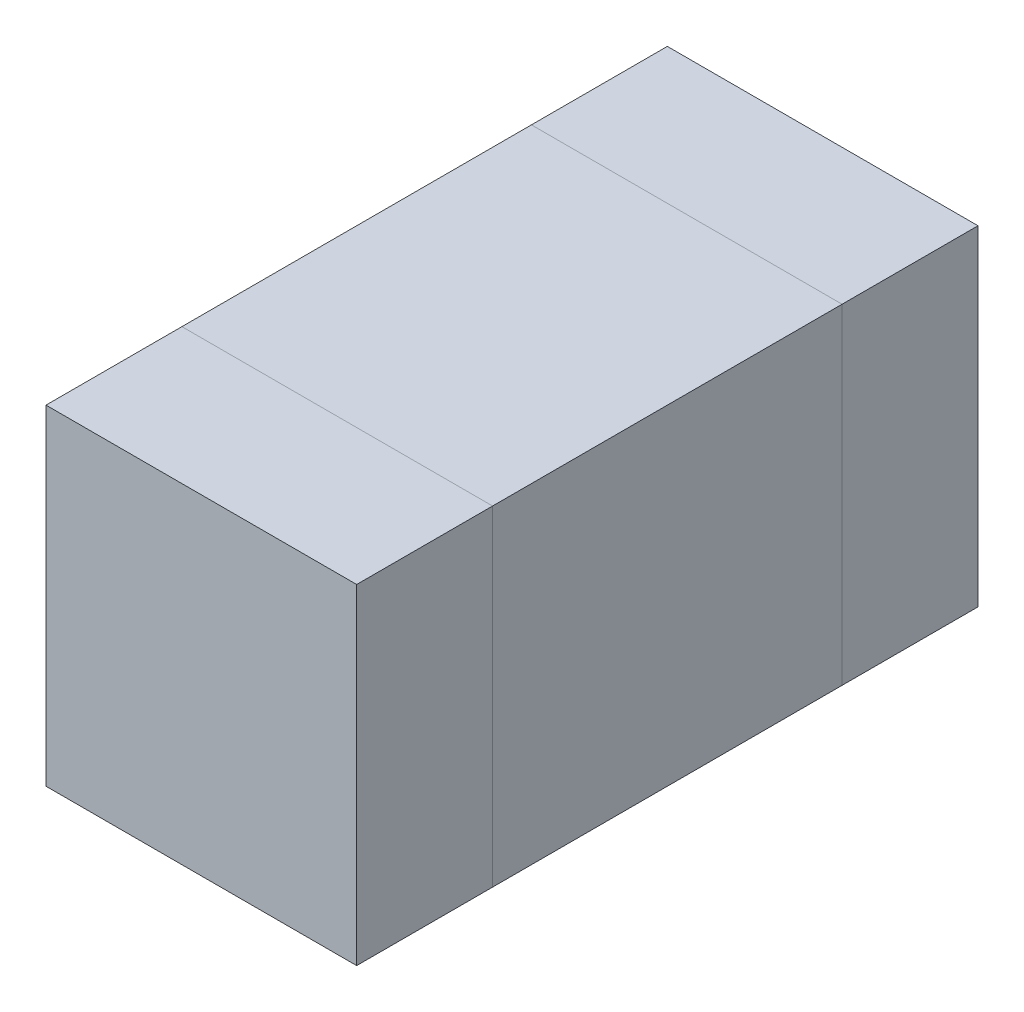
from build123d import *

# Parameters (mm, degrees)
SKETCH1_W  = 1.6
SKETCH1_H  = 1.8
MB_DEPTH   = 1.7
SKETCH2_W  = 1.6
SKETCH2_H  = 1.7
SB_L_DEPTH = 0.7
SKETCH3_W  = 1.6
SKETCH3_H  = 1.7
SB_R_DEPTH = 0.7


with BuildPart() as part:
    # Sketch1 → MB (new body)
    with BuildSketch(Plane(origin=(0, 0, 0), x_dir=(1, 0, 0), z_dir=(0, 1, 0))):
        Rectangle(SKETCH1_W, SKETCH1_H)
    extrude(amount=MB_DEPTH)


with BuildPart() as body_2:
    # Sketch2 → SB L (new body)
    with BuildSketch(Plane.XY.offset(0.9)):
        with Locations((0, 0.85)):
            Rectangle(SKETCH2_W, SKETCH2_H)
    extrude(amount=SB_L_DEPTH)


with BuildPart() as body_3:
    # Sketch3 → SB R (new body)
    with BuildSketch(Plane(origin=(0, 0, -0.9), x_dir=(-1, 0, 0), z_dir=(0, 0, -1))):
        with Locations((0, 0.85)):
            Rectangle(SKETCH3_W, SKETCH3_H)
    extrude(amount=SB_R_DEPTH)


solid = Compound([part.part, body_2.part, body_3.part])
